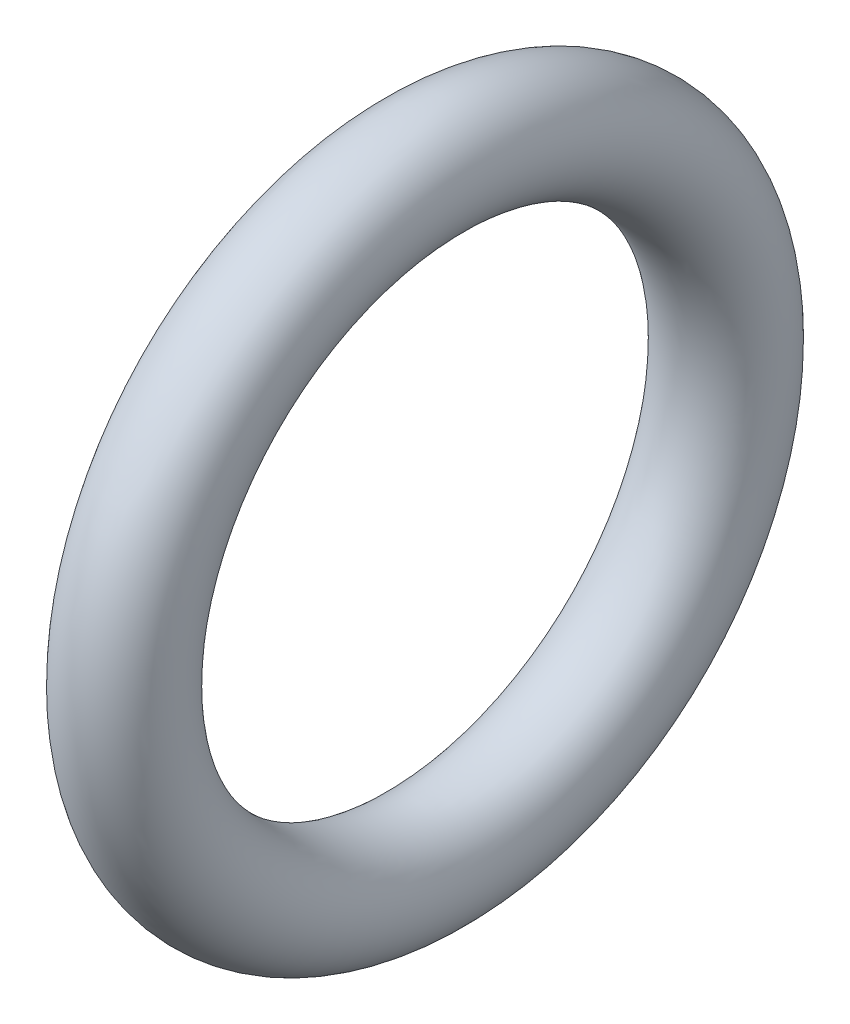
ISO-10303-21;
HEADER;
FILE_DESCRIPTION(('STEP AP214'),'2;1');
FILE_NAME('part.step','',(''),(''),'','','');
FILE_SCHEMA(('AUTOMOTIVE_DESIGN { 1 0 10303 214 1 1 1 1 }'));
ENDSEC;
DATA;
#1=APPLICATION_CONTEXT('core data for automotive mechanical design processes');
#2=APPLICATION_PROTOCOL_DEFINITION('international standard','automotive_design',2000,#1);
#3=PRODUCT_CONTEXT('',#1,'mechanical');
#4=PRODUCT('Part','Part','',(#3));
#5=PRODUCT_RELATED_PRODUCT_CATEGORY('part','',(#4));
#6=PRODUCT_DEFINITION_FORMATION('','',#4);
#7=PRODUCT_DEFINITION_CONTEXT('part definition',#1,'design');
#8=PRODUCT_DEFINITION('design','',#6,#7);
#9=PRODUCT_DEFINITION_SHAPE('','',#8);
#10=(LENGTH_UNIT() NAMED_UNIT(*) SI_UNIT(.MILLI.,.METRE.));
#11=(NAMED_UNIT(*) PLANE_ANGLE_UNIT() SI_UNIT($,.RADIAN.));
#12=(NAMED_UNIT(*) SI_UNIT($,.STERADIAN.) SOLID_ANGLE_UNIT());
#13=UNCERTAINTY_MEASURE_WITH_UNIT(LENGTH_MEASURE(1.E-05),#10,'distance_accuracy_value','');
#14=(GEOMETRIC_REPRESENTATION_CONTEXT(3) GLOBAL_UNCERTAINTY_ASSIGNED_CONTEXT((#13)) GLOBAL_UNIT_ASSIGNED_CONTEXT((#10,
#11,#12)) REPRESENTATION_CONTEXT('',''));
#15=CARTESIAN_POINT('',(0.,0.,0.));
#16=DIRECTION('',(0.,0.,1.));
#17=DIRECTION('',(1.,0.,0.));
#18=AXIS2_PLACEMENT_3D('',#15,#16,#17);
#19=CARTESIAN_POINT('',(0.,0.,0.));
#20=DIRECTION('',(1.,0.,0.));
#21=DIRECTION('',(0.,0.,-1.));
#22=AXIS2_PLACEMENT_3D('',#19,#20,#21);
#23=TOROIDAL_SURFACE('',#22,7.4,1.35);
#24=CARTESIAN_POINT('',(0.,0.,-8.75));
#25=VERTEX_POINT('',#24);
#26=VERTEX_LOOP('',#25);
#27=FACE_BOUND('',#26,.T.);
#28=ADVANCED_FACE('F28',(#27),#23,.T.);
#29=CLOSED_SHELL('',(#28));
#30=MANIFOLD_SOLID_BREP('B2',#29);
#31=ADVANCED_BREP_SHAPE_REPRESENTATION('',(#18,#30),#14);
#32=SHAPE_DEFINITION_REPRESENTATION(#9,#31);
ENDSEC;
END-ISO-10303-21;
